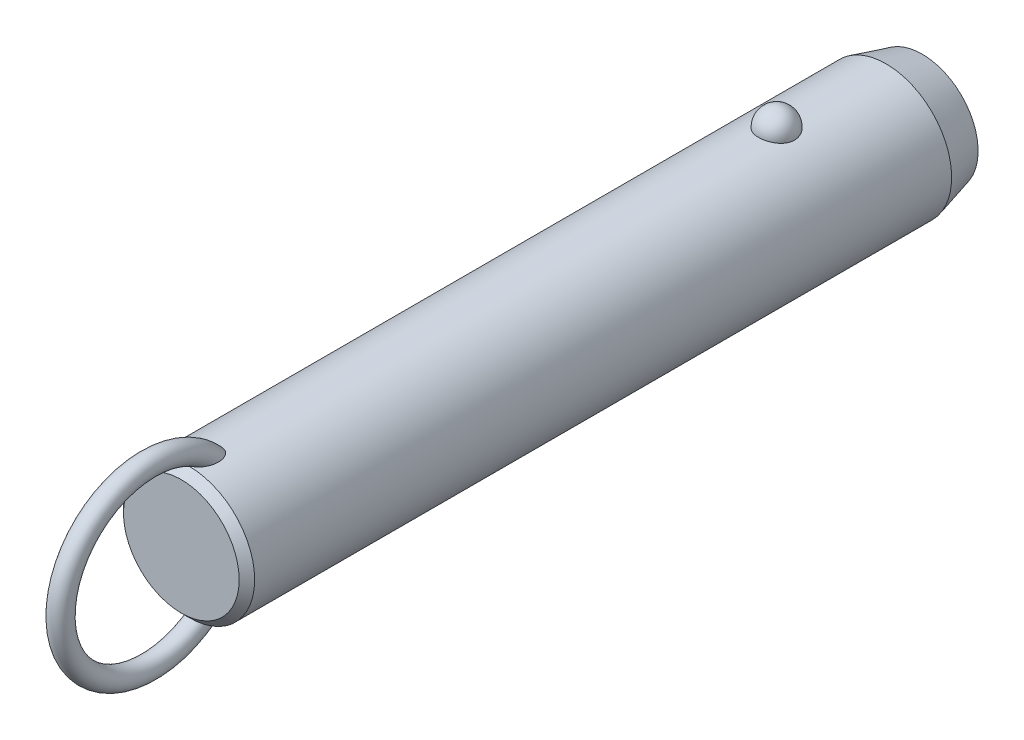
ISO-10303-21;
HEADER;
FILE_DESCRIPTION(('STEP AP214'),'2;1');
FILE_NAME('part.step','',(''),(''),'','','');
FILE_SCHEMA(('AUTOMOTIVE_DESIGN { 1 0 10303 214 1 1 1 1 }'));
ENDSEC;
DATA;
#1=APPLICATION_CONTEXT('core data for automotive mechanical design processes');
#2=APPLICATION_PROTOCOL_DEFINITION('international standard','automotive_design',2000,#1);
#3=PRODUCT_CONTEXT('',#1,'mechanical');
#4=PRODUCT('Part','Part','',(#3));
#5=PRODUCT_RELATED_PRODUCT_CATEGORY('part','',(#4));
#6=PRODUCT_DEFINITION_FORMATION('','',#4);
#7=PRODUCT_DEFINITION_CONTEXT('part definition',#1,'design');
#8=PRODUCT_DEFINITION('design','',#6,#7);
#9=PRODUCT_DEFINITION_SHAPE('','',#8);
#10=(LENGTH_UNIT() NAMED_UNIT(*) SI_UNIT(.MILLI.,.METRE.));
#11=(NAMED_UNIT(*) PLANE_ANGLE_UNIT() SI_UNIT($,.RADIAN.));
#12=(NAMED_UNIT(*) SI_UNIT($,.STERADIAN.) SOLID_ANGLE_UNIT());
#13=UNCERTAINTY_MEASURE_WITH_UNIT(LENGTH_MEASURE(1.E-05),#10,'distance_accuracy_value','');
#14=(GEOMETRIC_REPRESENTATION_CONTEXT(3) GLOBAL_UNCERTAINTY_ASSIGNED_CONTEXT((#13)) GLOBAL_UNIT_ASSIGNED_CONTEXT((#10,
#11,#12)) REPRESENTATION_CONTEXT('',''));
#15=CARTESIAN_POINT('',(0.,0.,0.));
#16=DIRECTION('',(0.,0.,1.));
#17=DIRECTION('',(1.,0.,0.));
#18=AXIS2_PLACEMENT_3D('',#15,#16,#17);
#19=CARTESIAN_POINT('',(0.,0.,99.1));
#20=DIRECTION('',(0.,0.,-1.));
#21=DIRECTION('',(-1.,0.,0.));
#22=AXIS2_PLACEMENT_3D('',#19,#20,#21);
#23=CYLINDRICAL_SURFACE('',#22,12.7);
#24=CARTESIAN_POINT('',(3.46661256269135,12.2177165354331,-3.5));
#25=CARTESIAN_POINT('',(3.4666090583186,12.2177194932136,-3.30432790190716));
#26=CARTESIAN_POINT('',(3.45063567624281,12.2222841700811,-3.10861112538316));
#27=CARTESIAN_POINT('',(3.38712451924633,12.2400345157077,-2.72271899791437));
#28=CARTESIAN_POINT('',(3.33957415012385,12.2532236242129,-2.53254588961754));
#29=CARTESIAN_POINT('',(3.2141234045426,12.286724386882,-2.16324948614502));
#30=CARTESIAN_POINT('',(3.13623639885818,12.3070329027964,-1.98412136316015));
#31=CARTESIAN_POINT('',(2.95205930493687,12.3525018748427,-1.64180592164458));
#32=CARTESIAN_POINT('',(2.84577003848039,12.3776621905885,-1.47861814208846));
#33=CARTESIAN_POINT('',(2.60688050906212,12.4301712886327,-1.17190583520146));
#34=CARTESIAN_POINT('',(2.47415697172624,12.4575299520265,-1.02847897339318));
#35=CARTESIAN_POINT('',(2.18615174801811,12.5112810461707,-0.766177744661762));
#36=CARTESIAN_POINT('',(2.03087002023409,12.5376734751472,-0.64730342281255));
#37=CARTESIAN_POINT('',(1.70237334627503,12.5864761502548,-0.437732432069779));
#38=CARTESIAN_POINT('',(1.52920948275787,12.6088972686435,-0.346958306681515));
#39=CARTESIAN_POINT('',(1.16944170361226,12.6473352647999,-0.195750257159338));
#40=CARTESIAN_POINT('',(0.982839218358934,12.663352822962,-0.135313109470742));
#41=CARTESIAN_POINT('',(0.604961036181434,12.6869706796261,-0.0473241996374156));
#42=CARTESIAN_POINT('',(0.41382314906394,12.6947125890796,-0.0192185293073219));
#43=CARTESIAN_POINT('',(0.0293827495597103,12.7014203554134,0.0051725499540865));
#44=CARTESIAN_POINT('',(-0.163919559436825,12.7003870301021,0.00146092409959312));
#45=CARTESIAN_POINT('',(-0.544374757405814,12.689735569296,-0.0373939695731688));
#46=CARTESIAN_POINT('',(-0.731575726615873,12.6802364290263,-0.0721015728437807));
#47=CARTESIAN_POINT('',(-1.09733277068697,12.6538333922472,-0.171364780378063));
#48=CARTESIAN_POINT('',(-1.27588869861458,12.6369293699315,-0.235920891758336));
#49=CARTESIAN_POINT('',(-1.6204698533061,12.5973946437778,-0.393548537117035));
#50=CARTESIAN_POINT('',(-1.78641865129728,12.5747321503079,-0.486778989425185));
#51=CARTESIAN_POINT('',(-2.10030671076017,12.5261316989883,-0.699110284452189));
#52=CARTESIAN_POINT('',(-2.24824419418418,12.5001934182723,-0.818213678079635));
#53=CARTESIAN_POINT('',(-2.52491489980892,12.4472906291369,-1.08157124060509));
#54=CARTESIAN_POINT('',(-2.65324222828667,12.4203160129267,-1.22624992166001));
#55=CARTESIAN_POINT('',(-2.88410007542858,12.3687509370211,-1.53528325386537));
#56=CARTESIAN_POINT('',(-2.98662883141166,12.3441606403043,-1.69963924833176));
#57=CARTESIAN_POINT('',(-3.16432417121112,12.2998199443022,-2.04548497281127));
#58=CARTESIAN_POINT('',(-3.23917525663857,12.2801261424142,-2.22714424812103));
#59=CARTESIAN_POINT('',(-3.35800573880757,12.248167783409,-2.6009138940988));
#60=CARTESIAN_POINT('',(-3.4019860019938,12.2359030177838,-2.79302397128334));
#61=CARTESIAN_POINT('',(-3.45784812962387,12.2202347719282,-3.18140279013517));
#62=CARTESIAN_POINT('',(-3.46986123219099,12.2167950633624,-3.37765118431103));
#63=CARTESIAN_POINT('',(-3.46186273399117,12.2190638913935,-3.76943689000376));
#64=CARTESIAN_POINT('',(-3.44185196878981,12.2247721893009,-3.96497421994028));
#65=CARTESIAN_POINT('',(-3.37048652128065,12.2446381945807,-4.34881728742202));
#66=CARTESIAN_POINT('',(-3.31928253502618,12.2587552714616,-4.53715319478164));
#67=CARTESIAN_POINT('',(-3.18693461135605,12.2938237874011,-4.90231727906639));
#68=CARTESIAN_POINT('',(-3.1057895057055,12.3147754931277,-5.07914500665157));
#69=CARTESIAN_POINT('',(-2.91506431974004,12.3613125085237,-5.41732059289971));
#70=CARTESIAN_POINT('',(-2.80533587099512,12.3869217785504,-5.57858147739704));
#71=CARTESIAN_POINT('',(-2.560414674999,12.4398525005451,-5.88013283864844));
#72=CARTESIAN_POINT('',(-2.42522099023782,12.4671740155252,-6.02042254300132));
#73=CARTESIAN_POINT('',(-2.1323357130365,12.5205965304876,-6.27662798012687));
#74=CARTESIAN_POINT('',(-1.97456596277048,12.5466928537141,-6.3924554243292));
#75=CARTESIAN_POINT('',(-1.64115839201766,12.5946384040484,-6.59583547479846));
#76=CARTESIAN_POINT('',(-1.46552179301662,12.6164879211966,-6.68339001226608));
#77=CARTESIAN_POINT('',(-1.10356050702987,12.6532533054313,-6.82682153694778));
#78=CARTESIAN_POINT('',(-0.9173913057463,12.6682500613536,-6.8830698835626));
#79=CARTESIAN_POINT('',(-0.537836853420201,12.6900288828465,-6.96386887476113));
#80=CARTESIAN_POINT('',(-0.344452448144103,12.6968119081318,-6.9884232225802));
#81=CARTESIAN_POINT('',(0.0402577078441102,12.7013667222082,-7.00496469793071));
#82=CARTESIAN_POINT('',(0.231556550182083,12.6993008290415,-6.99753844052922));
#83=CARTESIAN_POINT('',(0.610105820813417,12.6867505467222,-6.9516636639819));
#84=CARTESIAN_POINT('',(0.797356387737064,12.6762664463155,-6.913216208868));
#85=CARTESIAN_POINT('',(1.16186657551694,12.6480587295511,-6.80658431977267));
#86=CARTESIAN_POINT('',(1.33915951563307,12.6303611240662,-6.73850666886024));
#87=CARTESIAN_POINT('',(1.67968518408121,12.5896027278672,-6.5745087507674));
#88=CARTESIAN_POINT('',(1.84291705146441,12.5665416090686,-6.47858678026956));
#89=CARTESIAN_POINT('',(2.15340192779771,12.5171072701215,-6.25982455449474));
#90=CARTESIAN_POINT('',(2.30037831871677,12.4906895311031,-6.13660186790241));
#91=CARTESIAN_POINT('',(2.5717412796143,12.4376567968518,-5.86739587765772));
#92=CARTESIAN_POINT('',(2.69612388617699,12.4110417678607,-5.72140858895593));
#93=CARTESIAN_POINT('',(2.92107785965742,12.360051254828,-5.40794137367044));
#94=CARTESIAN_POINT('',(3.02121329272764,12.3357209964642,-5.24014110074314));
#95=CARTESIAN_POINT('',(3.19236291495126,12.2925446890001,-4.88969865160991));
#96=CARTESIAN_POINT('',(3.26338839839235,12.2736965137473,-4.70706226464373));
#97=CARTESIAN_POINT('',(3.36788038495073,12.245404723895,-4.35469510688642));
#98=CARTESIAN_POINT('',(3.40484026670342,12.2351018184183,-4.18605935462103));
#99=CARTESIAN_POINT('',(3.45420764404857,12.2212564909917,-3.84496058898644));
#100=CARTESIAN_POINT('',(3.46661565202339,12.2177139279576,-3.67249765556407));
#101=CARTESIAN_POINT('',(3.46661256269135,12.2177165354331,-3.5));
#102=B_SPLINE_CURVE_WITH_KNOTS('',3,(#24,#25,#26,#27,#28,#29,#30,#31,#32,#33,#34,#35,#36,#37,
#38,#39,#40,#41,#42,#43,#44,#45,#46,#47,#48,#49,#50,#51,#52,#53,#54,#55,#56,#57,#58,#59,#60,#61,
#62,#63,#64,#65,#66,#67,#68,#69,#70,#71,#72,#73,#74,#75,#76,#77,#78,#79,#80,#81,#82,#83,#84,#85,
#86,#87,#88,#89,#90,#91,#92,#93,#94,#95,#96,#97,#98,#99,#100,#101),.UNSPECIFIED.,.T.,.F.,(4,2,2,
2,2,2,2,2,2,2,2,2,2,2,2,2,2,2,2,2,2,2,2,2,2,2,2,2,2,2,2,2,2,2,2,2,2,2,4),(0.,0.586396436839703,
1.17302689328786,1.7593990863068,2.34575431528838,2.93491084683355,3.52406845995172,
4.11158733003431,4.69904375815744,5.2762784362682,5.85345931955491,6.42265312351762,
6.99185659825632,7.56427334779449,8.136746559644,8.71981013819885,9.3029135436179,
9.89247258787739,10.4820150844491,11.0691335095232,11.6562366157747,12.2405256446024,
12.8248374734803,13.412244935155,13.9996740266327,14.5891883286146,15.1786623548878,
15.7609861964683,16.3432419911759,16.9148635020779,17.4864654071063,18.0560241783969,
18.6256177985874,19.2037609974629,19.7820055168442,20.3699810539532,20.957728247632,
21.4746855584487,21.9916320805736),.UNSPECIFIED.);
#103=CARTESIAN_POINT('',(3.46661256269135,12.2177165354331,-3.5));
#104=VERTEX_POINT('',#103);
#105=EDGE_CURVE('E41',#104,#104,#102,.T.);
#106=ORIENTED_EDGE('',*,*,#105,.T.);
#107=EDGE_LOOP('',(#106));
#108=FACE_BOUND('',#107,.T.);
#109=CARTESIAN_POINT('',(0.,0.,110.3));
#110=DIRECTION('',(0.,0.,1.));
#111=DIRECTION('',(1.,0.,0.));
#112=AXIS2_PLACEMENT_3D('',#109,#110,#111);
#113=CIRCLE('',#112,12.7);
#114=CARTESIAN_POINT('',(12.7,0.,110.3));
#115=VERTEX_POINT('',#114);
#116=EDGE_CURVE('E10',#115,#115,#113,.F.);
#117=ORIENTED_EDGE('',*,*,#116,.T.);
#118=EDGE_LOOP('',(#117));
#119=FACE_BOUND('',#118,.T.);
#120=CARTESIAN_POINT('',(-0.548122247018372,-12.6881662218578,104.043218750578));
#121=CARTESIAN_POINT('',(-0.648865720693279,-12.6838128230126,104.077926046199));
#122=CARTESIAN_POINT('',(-0.746398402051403,-12.6783867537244,104.122042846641));
#123=CARTESIAN_POINT('',(-0.93212506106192,-12.666091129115,104.226764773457));
#124=CARTESIAN_POINT('',(-1.02030388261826,-12.6592192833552,104.287396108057));
#125=CARTESIAN_POINT('',(-1.18487740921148,-12.6448747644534,104.421847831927));
#126=CARTESIAN_POINT('',(-1.26134296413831,-12.637406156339,104.495582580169));
#127=CARTESIAN_POINT('',(-1.4023120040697,-12.6225412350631,104.653604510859));
#128=CARTESIAN_POINT('',(-1.46681470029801,-12.6151449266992,104.73789238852));
#129=CARTESIAN_POINT('',(-1.60714786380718,-12.5981718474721,104.949657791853));
#130=CARTESIAN_POINT('',(-1.67725126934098,-12.588900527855,105.080962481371));
#131=CARTESIAN_POINT('',(-1.79536591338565,-12.5725964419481,105.353247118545));
#132=CARTESIAN_POINT('',(-1.84333535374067,-12.5655679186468,105.494244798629));
#133=CARTESIAN_POINT('',(-1.93422576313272,-12.5519624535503,105.837645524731));
#134=CARTESIAN_POINT('',(-1.96788773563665,-12.5466298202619,106.042557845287));
#135=CARTESIAN_POINT('',(-1.9941399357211,-12.542463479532,106.351760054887));
#136=CARTESIAN_POINT('',(-1.99883864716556,-12.5417153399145,106.455298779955));
#137=CARTESIAN_POINT('',(-2.00078003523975,-12.5414074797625,106.66245124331));
#138=CARTESIAN_POINT('',(-1.99802449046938,-12.5418474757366,106.766064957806));
#139=CARTESIAN_POINT('',(-1.98336733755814,-12.5441750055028,107.010320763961));
#140=CARTESIAN_POINT('',(-1.96851430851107,-12.5465291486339,107.150780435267));
#141=CARTESIAN_POINT('',(-1.92707089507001,-12.5529612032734,107.429960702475));
#142=CARTESIAN_POINT('',(-1.90047458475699,-12.5570399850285,107.568680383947));
#143=CARTESIAN_POINT('',(-1.83619120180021,-12.5666008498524,107.84341135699));
#144=CARTESIAN_POINT('',(-1.79850828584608,-12.57208240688,107.979423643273));
#145=CARTESIAN_POINT('',(-1.71223796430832,-12.5841228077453,108.247842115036));
#146=CARTESIAN_POINT('',(-1.66365679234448,-12.5906810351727,108.380250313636));
#147=CARTESIAN_POINT('',(-1.5780450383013,-12.6016176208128,108.58548877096));
#148=CARTESIAN_POINT('',(-1.54477252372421,-12.6057501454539,108.659914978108));
#149=CARTESIAN_POINT('',(-1.47424480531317,-12.6141930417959,108.806839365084));
#150=CARTESIAN_POINT('',(-1.43699041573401,-12.6185033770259,108.879337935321));
#151=CARTESIAN_POINT('',(-1.35825795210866,-12.6272207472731,109.021892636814));
#152=CARTESIAN_POINT('',(-1.31678520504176,-12.6316276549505,109.091951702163));
#153=CARTESIAN_POINT('',(-1.22917793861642,-12.6404532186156,109.229070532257));
#154=CARTESIAN_POINT('',(-1.18304514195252,-12.6448718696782,109.296131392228));
#155=CARTESIAN_POINT('',(-1.07246411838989,-12.6547893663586,109.443874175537));
#156=CARTESIAN_POINT('',(-1.00642239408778,-12.6602600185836,109.523384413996));
#157=CARTESIAN_POINT('',(-0.864441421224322,-12.6707460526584,109.673169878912));
#158=CARTESIAN_POINT('',(-0.788516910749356,-12.6757620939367,109.743458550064));
#159=CARTESIAN_POINT('',(-0.652215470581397,-12.6833591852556,109.848680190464));
#160=CARTESIAN_POINT('',(-0.594982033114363,-12.6861973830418,109.887624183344));
#161=CARTESIAN_POINT('',(-0.475269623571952,-12.6912445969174,109.956489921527));
#162=CARTESIAN_POINT('',(-0.412800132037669,-12.6934547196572,109.986427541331));
#163=CARTESIAN_POINT('',(-0.295749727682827,-12.6966636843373,110.029756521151));
#164=CARTESIAN_POINT('',(-0.241949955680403,-12.6978134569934,110.045218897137));
#165=CARTESIAN_POINT('',(-0.132508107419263,-12.6994261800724,110.066884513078));
#166=CARTESIAN_POINT('',(-0.0768679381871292,-12.6998898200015,110.073097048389));
#167=CARTESIAN_POINT('',(0.0347696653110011,-12.7000752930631,110.075583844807));
#168=CARTESIAN_POINT('',(0.0907676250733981,-12.6997954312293,110.071835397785));
#169=CARTESIAN_POINT('',(0.201283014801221,-12.6985255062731,110.054788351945));
#170=CARTESIAN_POINT('',(0.255799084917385,-12.6975348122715,110.041481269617));
#171=CARTESIAN_POINT('',(0.376042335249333,-12.6946091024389,110.00203792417));
#172=CARTESIAN_POINT('',(0.44095085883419,-12.6924943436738,109.973449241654));
#173=CARTESIAN_POINT('',(0.565350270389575,-12.6875639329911,109.906323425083));
#174=CARTESIAN_POINT('',(0.624828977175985,-12.6847467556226,109.867764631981));
#175=CARTESIAN_POINT('',(0.774116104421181,-12.6767252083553,109.756949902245));
#176=CARTESIAN_POINT('',(0.859449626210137,-12.6711344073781,109.678760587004));
#177=CARTESIAN_POINT('',(1.01789440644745,-12.6593922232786,109.510943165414));
#178=CARTESIAN_POINT('',(1.09096902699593,-12.653239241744,109.421282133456));
#179=CARTESIAN_POINT('',(1.22268793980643,-12.6411674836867,109.240265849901));
#180=CARTESIAN_POINT('',(1.28193986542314,-12.6352572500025,109.149345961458));
#181=CARTESIAN_POINT('',(1.39259777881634,-12.6235401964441,108.962792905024));
#182=CARTESIAN_POINT('',(1.44399707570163,-12.6177334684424,108.867155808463));
#183=CARTESIAN_POINT('',(1.53972870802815,-12.6064093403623,108.672273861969));
#184=CARTESIAN_POINT('',(1.58405262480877,-12.6008922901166,108.573024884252));
#185=CARTESIAN_POINT('',(1.66600705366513,-12.5903187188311,108.371772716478));
#186=CARTESIAN_POINT('',(1.70363651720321,-12.5852622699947,108.269769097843));
#187=CARTESIAN_POINT('',(1.77545379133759,-12.5753406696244,108.054358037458));
#188=CARTESIAN_POINT('',(1.80903453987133,-12.5705328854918,107.940745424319));
#189=CARTESIAN_POINT('',(1.86844163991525,-12.5618400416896,107.711457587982));
#190=CARTESIAN_POINT('',(1.89426665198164,-12.5579551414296,107.595782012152));
#191=CARTESIAN_POINT('',(1.9378546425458,-12.5513030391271,107.363007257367));
#192=CARTESIAN_POINT('',(1.9556264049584,-12.5485346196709,107.245909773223));
#193=CARTESIAN_POINT('',(1.98264463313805,-12.5442934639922,107.010747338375));
#194=CARTESIAN_POINT('',(1.99189298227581,-12.5428204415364,106.89268260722));
#195=CARTESIAN_POINT('',(2.00416068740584,-12.540871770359,106.580622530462));
#196=CARTESIAN_POINT('',(1.99944433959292,-12.541631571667,106.386229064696));
#197=CARTESIAN_POINT('',(1.96113755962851,-12.5476846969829,106.000309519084));
#198=CARTESIAN_POINT('',(1.92758341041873,-12.5529723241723,105.808780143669));
#199=CARTESIAN_POINT('',(1.83934342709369,-12.5661532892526,105.482272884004));
#200=CARTESIAN_POINT('',(1.79215440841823,-12.5730485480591,105.34524997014));
#201=CARTESIAN_POINT('',(1.67676242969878,-12.588958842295,105.080445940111));
#202=CARTESIAN_POINT('',(1.60859050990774,-12.597970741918,104.952651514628));
#203=CARTESIAN_POINT('',(1.46583832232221,-12.6152829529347,104.735800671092));
#204=CARTESIAN_POINT('',(1.39525727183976,-12.6233659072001,104.64410500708));
#205=CARTESIAN_POINT('',(1.23992594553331,-12.6395676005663,104.473485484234));
#206=CARTESIAN_POINT('',(1.1551793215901,-12.6476863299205,104.394558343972));
#207=CARTESIAN_POINT('',(0.971995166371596,-12.6630846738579,104.252643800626));
#208=CARTESIAN_POINT('',(0.873456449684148,-12.6703572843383,104.189784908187));
#209=CARTESIAN_POINT('',(0.665847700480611,-12.6829569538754,104.084487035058));
#210=CARTESIAN_POINT('',(0.556784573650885,-12.688285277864,104.042034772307));
#211=CARTESIAN_POINT('',(0.347338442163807,-12.6956226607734,103.984443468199));
#212=CARTESIAN_POINT('',(0.247759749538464,-12.6979816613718,103.966399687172));
#213=CARTESIAN_POINT('',(0.0470218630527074,-12.7003077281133,103.948600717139));
#214=CARTESIAN_POINT('',(-0.0541350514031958,-12.7002779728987,103.948821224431));
#215=CARTESIAN_POINT('',(-0.221414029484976,-12.6982482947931,103.964363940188));
#216=CARTESIAN_POINT('',(-0.288055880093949,-12.6969033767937,103.974666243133));
#217=CARTESIAN_POINT('',(-0.419599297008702,-12.6932369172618,104.00313489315));
#218=CARTESIAN_POINT('',(-0.484501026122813,-12.6909154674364,104.021300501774));
#219=CARTESIAN_POINT('',(-0.548122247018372,-12.6881662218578,104.043218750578));
#220=B_SPLINE_CURVE_WITH_KNOTS('',3,(#120,#121,#122,#123,#124,#125,#126,#127,#128,#129,#130,
#131,#132,#133,#134,#135,#136,#137,#138,#139,#140,#141,#142,#143,#144,#145,#146,#147,#148,#149,
#150,#151,#152,#153,#154,#155,#156,#157,#158,#159,#160,#161,#162,#163,#164,#165,#166,#167,#168,
#169,#170,#171,#172,#173,#174,#175,#176,#177,#178,#179,#180,#181,#182,#183,#184,#185,#186,#187,
#188,#189,#190,#191,#192,#193,#194,#195,#196,#197,#198,#199,#200,#201,#202,#203,#204,#205,#206,
#207,#208,#209,#210,#211,#212,#213,#214,#215,#216,#217,#218,#219),.UNSPECIFIED.,.T.,.F.,(4,2,2,
2,2,2,2,2,2,2,2,2,2,2,2,2,2,2,2,2,2,2,2,2,2,2,2,2,2,2,2,2,2,2,2,2,2,2,2,2,2,2,2,2,2,2,2,2,2,4),
(0.,0.31964225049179,0.639794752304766,0.957927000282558,1.27608021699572,1.72100165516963,
2.16675988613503,2.78630021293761,3.0970578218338,3.40774128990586,3.83096358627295,
4.2543996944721,4.67767724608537,5.10071330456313,5.34550297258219,5.59024267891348,
5.83467707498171,6.07902143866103,6.38891080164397,6.69834321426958,6.90560910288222,
7.11250749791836,7.27977315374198,7.44687060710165,7.61434932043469,7.78197685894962,
7.99365544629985,8.20579780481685,8.55147335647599,8.89816429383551,9.22375138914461,
9.5496143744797,9.87586224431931,10.202161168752,10.557587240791,10.9130746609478,
11.2681734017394,11.6231936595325,12.2046601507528,12.7853961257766,13.219164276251,
13.6522938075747,13.9989174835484,14.3454519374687,14.6946768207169,15.0436740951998,
15.3457513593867,15.6474266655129,15.8493051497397,16.0511646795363),.UNSPECIFIED.);
#221=CARTESIAN_POINT('',(-0.548122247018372,-12.6881662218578,104.043218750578));
#222=VERTEX_POINT('',#221);
#223=EDGE_CURVE('E60',#222,#222,#220,.T.);
#224=ORIENTED_EDGE('',*,*,#223,.T.);
#225=EDGE_LOOP('',(#224));
#226=FACE_BOUND('',#225,.T.);
#227=CARTESIAN_POINT('',(-0.548122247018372,12.6881662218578,104.043218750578));
#228=CARTESIAN_POINT('',(-0.459436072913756,12.6919968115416,104.012673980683));
#229=CARTESIAN_POINT('',(-0.368189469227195,12.6949996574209,103.989391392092));
#230=CARTESIAN_POINT('',(-0.183024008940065,12.6990186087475,103.958406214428));
#231=CARTESIAN_POINT('',(-0.0891049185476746,12.7000345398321,103.950704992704));
#232=CARTESIAN_POINT('',(0.0987147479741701,12.6999636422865,103.951245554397));
#233=CARTESIAN_POINT('',(0.192615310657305,12.6988761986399,103.959492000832));
#234=CARTESIAN_POINT('',(0.377658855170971,12.6947211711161,103.991551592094));
#235=CARTESIAN_POINT('',(0.468801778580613,12.6916535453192,104.015365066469));
#236=CARTESIAN_POINT('',(0.645809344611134,12.6838788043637,104.07745651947));
#237=CARTESIAN_POINT('',(0.731679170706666,12.6791733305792,104.115720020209));
#238=CARTESIAN_POINT('',(0.896315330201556,12.6686004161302,104.205120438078));
#239=CARTESIAN_POINT('',(0.975080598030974,12.6627328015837,104.256259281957));
#240=CARTESIAN_POINT('',(1.12963655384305,12.6499161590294,104.37367820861));
#241=CARTESIAN_POINT('',(1.20478673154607,12.6429194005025,104.440792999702));
#242=CARTESIAN_POINT('',(1.34448241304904,12.6288282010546,104.58522507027));
#243=CARTESIAN_POINT('',(1.40902173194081,12.621733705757,104.662548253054));
#244=CARTESIAN_POINT('',(1.55208211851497,12.6050877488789,104.859247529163));
#245=CARTESIAN_POINT('',(1.62510490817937,12.5957546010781,104.982654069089));
#246=CARTESIAN_POINT('',(1.7501904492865,12.5789823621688,105.239769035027));
#247=CARTESIAN_POINT('',(1.80221377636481,12.5715468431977,105.373496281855));
#248=CARTESIAN_POINT('',(1.90309965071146,12.5567434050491,105.698351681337));
#249=CARTESIAN_POINT('',(1.94342317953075,12.5504515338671,105.892161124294));
#250=CARTESIAN_POINT('',(1.99332997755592,12.5426147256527,106.28378810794));
#251=CARTESIAN_POINT('',(2.00285305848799,12.5410790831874,106.481612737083));
#252=CARTESIAN_POINT('',(1.99678999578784,12.5420407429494,106.816642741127));
#253=CARTESIAN_POINT('',(1.98794117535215,12.5434564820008,106.954042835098));
#254=CARTESIAN_POINT('',(1.95865119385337,12.5480641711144,107.227639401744));
#255=CARTESIAN_POINT('',(1.93820436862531,12.5512569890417,107.363835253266));
#256=CARTESIAN_POINT('',(1.88647896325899,12.5591352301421,107.634249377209));
#257=CARTESIAN_POINT('',(1.85518800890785,12.5638223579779,107.768465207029));
#258=CARTESIAN_POINT('',(1.78217886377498,12.5743868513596,108.033936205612));
#259=CARTESIAN_POINT('',(1.74046509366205,12.5802637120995,108.165192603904));
#260=CARTESIAN_POINT('',(1.66024095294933,12.5910571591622,108.386085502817));
#261=CARTESIAN_POINT('',(1.62434772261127,12.5957535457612,108.476690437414));
#262=CARTESIAN_POINT('',(1.5470900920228,12.6054762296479,108.655512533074));
#263=CARTESIAN_POINT('',(1.50572681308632,12.6105024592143,108.743730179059));
#264=CARTESIAN_POINT('',(1.41728020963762,12.620748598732,108.916932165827));
#265=CARTESIAN_POINT('',(1.37021377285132,12.625967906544,109.001925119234));
#266=CARTESIAN_POINT('',(1.2696962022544,12.6364721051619,109.168007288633));
#267=CARTESIAN_POINT('',(1.21624929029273,12.6417569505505,109.249099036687));
#268=CARTESIAN_POINT('',(1.10304413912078,12.6521331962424,109.404702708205));
#269=CARTESIAN_POINT('',(1.04340936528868,12.657226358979,109.479303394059));
#270=CARTESIAN_POINT('',(0.91591933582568,12.6670906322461,109.621324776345));
#271=CARTESIAN_POINT('',(0.84806456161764,12.6718617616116,109.68874589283));
#272=CARTESIAN_POINT('',(0.717035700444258,12.67987711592,109.800624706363));
#273=CARTESIAN_POINT('',(0.655526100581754,12.6832377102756,109.846997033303));
#274=CARTESIAN_POINT('',(0.525985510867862,12.6892676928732,109.929619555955));
#275=CARTESIAN_POINT('',(0.45796984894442,12.6919386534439,109.965892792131));
#276=CARTESIAN_POINT('',(0.334859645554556,12.695691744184,110.016657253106));
#277=CARTESIAN_POINT('',(0.281116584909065,12.6970073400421,110.034373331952));
#278=CARTESIAN_POINT('',(0.171425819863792,12.6989609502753,110.060642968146));
#279=CARTESIAN_POINT('',(0.11548082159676,12.699599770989,110.069207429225));
#280=CARTESIAN_POINT('',(0.00272618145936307,12.7001251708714,110.076253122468));
#281=CARTESIAN_POINT('',(-0.0540859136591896,12.7000089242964,110.074696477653));
#282=CARTESIAN_POINT('',(-0.166544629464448,12.6990328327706,110.061600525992));
#283=CARTESIAN_POINT('',(-0.222190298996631,12.6981724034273,110.050053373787));
#284=CARTESIAN_POINT('',(-0.342018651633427,12.695562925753,110.014912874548));
#285=CARTESIAN_POINT('',(-0.405606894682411,12.6936676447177,109.98933225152));
#286=CARTESIAN_POINT('',(-0.527815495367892,12.6891754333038,109.928311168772));
#287=CARTESIAN_POINT('',(-0.586425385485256,12.6865770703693,109.892850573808));
#288=CARTESIAN_POINT('',(-0.731842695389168,12.6792129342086,109.791496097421));
#289=CARTESIAN_POINT('',(-0.814709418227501,12.6740767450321,109.7200395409));
#290=CARTESIAN_POINT('',(-0.969101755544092,12.6632083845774,109.56589007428));
#291=CARTESIAN_POINT('',(-1.04059564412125,12.6574746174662,109.483166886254));
#292=CARTESIAN_POINT('',(-1.1698111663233,12.6461638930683,109.315809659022));
#293=CARTESIAN_POINT('',(-1.22811369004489,12.6405994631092,109.231616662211));
#294=CARTESIAN_POINT('',(-1.33743405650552,12.6295007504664,109.058579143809));
#295=CARTESIAN_POINT('',(-1.38844577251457,12.6239664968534,108.969730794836));
#296=CARTESIAN_POINT('',(-1.48400702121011,12.6130898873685,108.788389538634));
#297=CARTESIAN_POINT('',(-1.52854232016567,12.6077479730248,108.695889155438));
#298=CARTESIAN_POINT('',(-1.6115011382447,12.5974127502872,108.508160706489));
#299=CARTESIAN_POINT('',(-1.64992317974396,12.5924195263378,108.412931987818));
#300=CARTESIAN_POINT('',(-1.73468589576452,12.581070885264,108.18289362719));
#301=CARTESIAN_POINT('',(-1.77831261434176,12.5749388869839,108.047066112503));
#302=CARTESIAN_POINT('',(-1.85439734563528,12.5639437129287,107.772212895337));
#303=CARTESIAN_POINT('',(-1.88684994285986,12.5590811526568,107.633185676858));
#304=CARTESIAN_POINT('',(-1.94008483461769,12.550968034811,107.35309235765));
#305=CARTESIAN_POINT('',(-1.96088706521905,12.5477147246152,107.212030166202));
#306=CARTESIAN_POINT('',(-1.99000539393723,12.5431291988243,106.928668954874));
#307=CARTESIAN_POINT('',(-1.99832911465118,12.5417958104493,106.786370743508));
#308=CARTESIAN_POINT('',(-2.00166624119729,12.5412674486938,106.457627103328));
#309=CARTESIAN_POINT('',(-1.99178843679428,12.5428579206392,106.271088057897));
#310=CARTESIAN_POINT('',(-1.9445518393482,12.5502731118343,105.90162404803));
#311=CARTESIAN_POINT('',(-1.90724032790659,12.5560905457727,105.718693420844));
#312=CARTESIAN_POINT('',(-1.81330718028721,12.5699462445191,105.404848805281));
#313=CARTESIAN_POINT('',(-1.76338820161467,12.5771273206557,105.271910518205));
#314=CARTESIAN_POINT('',(-1.64305018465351,12.593414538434,105.015681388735));
#315=CARTESIAN_POINT('',(-1.57265346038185,12.6025185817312,104.892380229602));
#316=CARTESIAN_POINT('',(-1.42634956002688,12.6198178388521,104.683564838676));
#317=CARTESIAN_POINT('',(-1.35423772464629,12.6278405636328,104.595384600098));
#318=CARTESIAN_POINT('',(-1.19645664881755,12.6437632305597,104.432107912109));
#319=CARTESIAN_POINT('',(-1.11080536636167,12.6516633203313,104.356994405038));
#320=CARTESIAN_POINT('',(-0.947219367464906,12.6648319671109,104.237811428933));
#321=CARTESIAN_POINT('',(-0.871624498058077,12.670300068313,104.190541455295));
#322=CARTESIAN_POINT('',(-0.714161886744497,12.6801492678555,104.1077413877));
#323=CARTESIAN_POINT('',(-0.632295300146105,12.684530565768,104.07220913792));
#324=CARTESIAN_POINT('',(-0.548122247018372,12.6881662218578,104.043218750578));
#325=B_SPLINE_CURVE_WITH_KNOTS('',3,(#227,#228,#229,#230,#231,#232,#233,#234,#235,#236,#237,
#238,#239,#240,#241,#242,#243,#244,#245,#246,#247,#248,#249,#250,#251,#252,#253,#254,#255,#256,
#257,#258,#259,#260,#261,#262,#263,#264,#265,#266,#267,#268,#269,#270,#271,#272,#273,#274,#275,
#276,#277,#278,#279,#280,#281,#282,#283,#284,#285,#286,#287,#288,#289,#290,#291,#292,#293,#294,
#295,#296,#297,#298,#299,#300,#301,#302,#303,#304,#305,#306,#307,#308,#309,#310,#311,#312,#313,
#314,#315,#316,#317,#318,#319,#320,#321,#322,#323,#324),.UNSPECIFIED.,.T.,.F.,(4,2,2,2,2,2,2,2,
2,2,2,2,2,2,2,2,2,2,2,2,2,2,2,2,2,2,2,2,2,2,2,2,2,2,2,2,2,2,2,2,2,2,2,2,2,2,2,2,4),(0.,
0.281328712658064,0.562682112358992,0.844117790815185,1.12555942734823,1.40671982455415,
1.68792232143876,1.98972294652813,2.29169886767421,2.72039860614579,3.14989948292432,
3.74084916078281,4.33295293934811,4.74554109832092,5.15833092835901,5.57159335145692,
5.98468079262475,6.2772277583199,6.56971484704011,6.86135609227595,7.15280542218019,
7.43927407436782,7.72572595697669,7.95635862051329,8.18646071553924,8.35559393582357,
8.52452541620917,8.69408946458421,8.86378678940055,9.06834348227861,9.27332014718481,
9.60010414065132,9.92778432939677,10.2350252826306,10.5425229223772,10.8506864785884,
11.1589244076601,11.5867893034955,12.0148612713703,12.4421984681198,12.8692745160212,
13.4279365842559,13.9856380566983,14.4107062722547,14.8353130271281,15.1765567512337,
15.5173516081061,15.7844129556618,16.051425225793),.UNSPECIFIED.);
#326=CARTESIAN_POINT('',(-0.548122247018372,12.6881662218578,104.043218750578));
#327=VERTEX_POINT('',#326);
#328=EDGE_CURVE('E68',#327,#327,#325,.T.);
#329=ORIENTED_EDGE('',*,*,#328,.T.);
#330=EDGE_LOOP('',(#329));
#331=FACE_BOUND('',#330,.T.);
#332=CARTESIAN_POINT('',(0.,0.,-24.6999999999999));
#333=DIRECTION('',(0.,0.,-1.));
#334=DIRECTION('',(-1.,0.,0.));
#335=AXIS2_PLACEMENT_3D('',#332,#333,#334);
#336=CIRCLE('',#335,12.7);
#337=CARTESIAN_POINT('',(-12.7,0.,-24.6999999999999));
#338=VERTEX_POINT('',#337);
#339=EDGE_CURVE('E57',#338,#338,#336,.F.);
#340=ORIENTED_EDGE('',*,*,#339,.T.);
#341=EDGE_LOOP('',(#340));
#342=FACE_BOUND('',#341,.T.);
#343=ADVANCED_FACE('F37',(#108,#119,#226,#331,#342),#23,.T.);
#344=CARTESIAN_POINT('',(0.,0.,-31.7));
#345=DIRECTION('',(0.,0.,-1.));
#346=DIRECTION('',(-1.,0.,0.));
#347=AXIS2_PLACEMENT_3D('',#344,#345,#346);
#348=PLANE('',#347);
#349=CARTESIAN_POINT('',(0.,0.,-31.7));
#350=DIRECTION('',(0.,0.,-1.));
#351=DIRECTION('',(-1.,0.,0.));
#352=AXIS2_PLACEMENT_3D('',#349,#350,#351);
#353=CIRCLE('',#352,10.8243556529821);
#354=CARTESIAN_POINT('',(-10.8243556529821,0.,-31.7));
#355=VERTEX_POINT('',#354);
#356=EDGE_CURVE('E67',#355,#355,#353,.T.);
#357=ORIENTED_EDGE('',*,*,#356,.T.);
#358=EDGE_LOOP('',(#357));
#359=FACE_BOUND('',#358,.T.);
#360=ADVANCED_FACE('F86',(#359),#348,.T.);
#361=CARTESIAN_POINT('',(0.,0.,-31.7));
#362=DIRECTION('',(0.,0.,1.));
#363=DIRECTION('',(1.,0.,0.));
#364=AXIS2_PLACEMENT_3D('',#361,#362,#363);
#365=CONICAL_SURFACE('',#364,10.8243556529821,0.261799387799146);
#366=ORIENTED_EDGE('',*,*,#339,.F.);
#367=EDGE_LOOP('',(#366));
#368=FACE_BOUND('',#367,.T.);
#369=ORIENTED_EDGE('',*,*,#356,.F.);
#370=EDGE_LOOP('',(#369));
#371=FACE_BOUND('',#370,.T.);
#372=ADVANCED_FACE('F84',(#368,#371),#365,.T.);
#373=CARTESIAN_POINT('',(0.,0.,111.8));
#374=DIRECTION('',(0.,0.,1.));
#375=DIRECTION('',(1.,0.,0.));
#376=AXIS2_PLACEMENT_3D('',#373,#374,#375);
#377=PLANE('',#376);
#378=CARTESIAN_POINT('',(0.,0.,111.8));
#379=DIRECTION('',(0.,0.,1.));
#380=DIRECTION('',(1.,0.,0.));
#381=AXIS2_PLACEMENT_3D('',#378,#379,#380);
#382=CIRCLE('',#381,11.2);
#383=CARTESIAN_POINT('',(11.2,0.,111.8));
#384=VERTEX_POINT('',#383);
#385=EDGE_CURVE('E50',#384,#384,#382,.T.);
#386=ORIENTED_EDGE('',*,*,#385,.T.);
#387=EDGE_LOOP('',(#386));
#388=FACE_BOUND('',#387,.T.);
#389=ADVANCED_FACE('F78',(#388),#377,.T.);
#390=CARTESIAN_POINT('',(0.,0.,118.15));
#391=DIRECTION('',(1.,0.,0.));
#392=DIRECTION('',(0.,0.,-1.));
#393=AXIS2_PLACEMENT_3D('',#390,#391,#392);
#394=TOROIDAL_SURFACE('',#393,17.05,2.);
#395=ORIENTED_EDGE('',*,*,#328,.F.);
#396=EDGE_LOOP('',(#395));
#397=FACE_BOUND('',#396,.T.);
#398=ORIENTED_EDGE('',*,*,#223,.F.);
#399=EDGE_LOOP('',(#398));
#400=FACE_BOUND('',#399,.T.);
#401=ADVANCED_FACE('F74',(#397,#400),#394,.T.);
#402=CARTESIAN_POINT('',(0.,0.,111.8));
#403=DIRECTION('',(0.,0.,-1.));
#404=DIRECTION('',(-1.,0.,0.));
#405=AXIS2_PLACEMENT_3D('',#402,#403,#404);
#406=CONICAL_SURFACE('',#405,11.2,0.785398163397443);
#407=ORIENTED_EDGE('',*,*,#116,.F.);
#408=EDGE_LOOP('',(#407));
#409=FACE_BOUND('',#408,.T.);
#410=ORIENTED_EDGE('',*,*,#385,.F.);
#411=EDGE_LOOP('',(#410));
#412=FACE_BOUND('',#411,.T.);
#413=ADVANCED_FACE('F39',(#409,#412),#406,.T.);
#414=CARTESIAN_POINT('',(0.,12.7,-3.5));
#415=DIRECTION('',(0.,1.,0.));
#416=DIRECTION('',(0.,0.,-1.));
#417=AXIS2_PLACEMENT_3D('',#414,#415,#416);
#418=SPHERICAL_SURFACE('',#417,3.5);
#419=ORIENTED_EDGE('',*,*,#105,.F.);
#420=EDGE_LOOP('',(#419));
#421=FACE_BOUND('',#420,.T.);
#422=ADVANCED_FACE('F80',(#421),#418,.T.);
#423=CLOSED_SHELL('',(#343,#360,#372,#389,#401,#413,#422));
#424=MANIFOLD_SOLID_BREP('B2',#423);
#425=ADVANCED_BREP_SHAPE_REPRESENTATION('',(#18,#424),#14);
#426=SHAPE_DEFINITION_REPRESENTATION(#9,#425);
ENDSEC;
END-ISO-10303-21;
